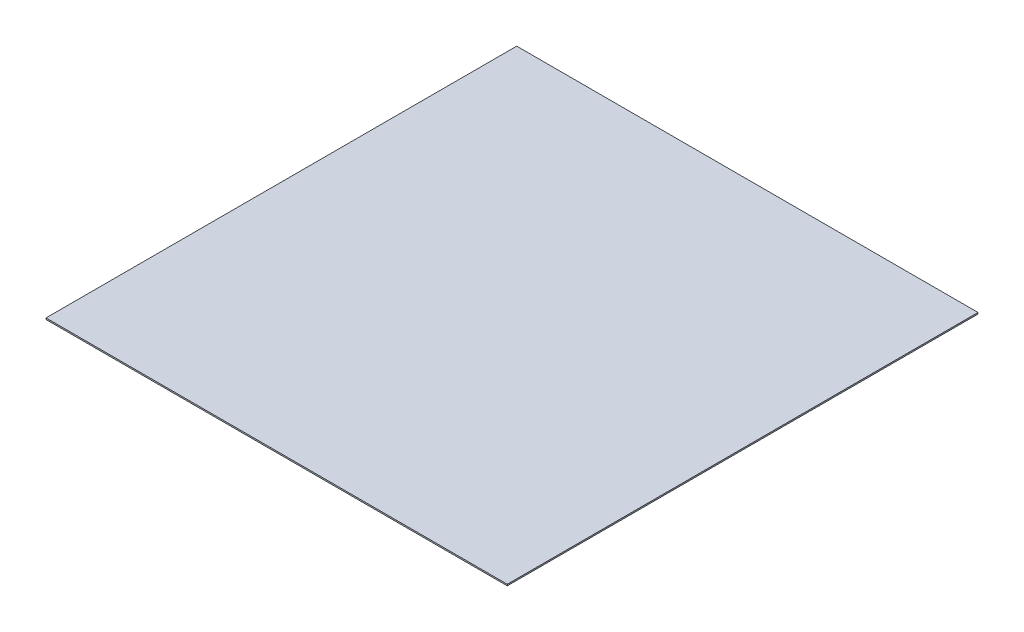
ISO-10303-21;
HEADER;
FILE_DESCRIPTION(('STEP AP214'),'2;1');
FILE_NAME('part.step','',(''),(''),'','','');
FILE_SCHEMA(('AUTOMOTIVE_DESIGN { 1 0 10303 214 1 1 1 1 }'));
ENDSEC;
DATA;
#1=APPLICATION_CONTEXT('core data for automotive mechanical design processes');
#2=APPLICATION_PROTOCOL_DEFINITION('international standard','automotive_design',2000,#1);
#3=PRODUCT_CONTEXT('',#1,'mechanical');
#4=PRODUCT('Part','Part','',(#3));
#5=PRODUCT_RELATED_PRODUCT_CATEGORY('part','',(#4));
#6=PRODUCT_DEFINITION_FORMATION('','',#4);
#7=PRODUCT_DEFINITION_CONTEXT('part definition',#1,'design');
#8=PRODUCT_DEFINITION('design','',#6,#7);
#9=PRODUCT_DEFINITION_SHAPE('','',#8);
#10=(LENGTH_UNIT() NAMED_UNIT(*) SI_UNIT(.MILLI.,.METRE.));
#11=(NAMED_UNIT(*) PLANE_ANGLE_UNIT() SI_UNIT($,.RADIAN.));
#12=(NAMED_UNIT(*) SI_UNIT($,.STERADIAN.) SOLID_ANGLE_UNIT());
#13=UNCERTAINTY_MEASURE_WITH_UNIT(LENGTH_MEASURE(1.E-05),#10,'distance_accuracy_value','');
#14=(GEOMETRIC_REPRESENTATION_CONTEXT(3) GLOBAL_UNCERTAINTY_ASSIGNED_CONTEXT((#13)) GLOBAL_UNIT_ASSIGNED_CONTEXT((#10,
#11,#12)) REPRESENTATION_CONTEXT('',''));
#15=CARTESIAN_POINT('',(0.,0.,0.));
#16=DIRECTION('',(0.,0.,1.));
#17=DIRECTION('',(1.,0.,0.));
#18=AXIS2_PLACEMENT_3D('',#15,#16,#17);
#19=CARTESIAN_POINT('',(-489.999999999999,3.,0.));
#20=DIRECTION('',(1.,0.,0.));
#21=DIRECTION('',(0.,0.,-1.));
#22=AXIS2_PLACEMENT_3D('',#19,#20,#21);
#23=PLANE('',#22);
#24=DIRECTION('',(0.,0.,1.));
#25=VECTOR('',#24,1.);
#26=CARTESIAN_POINT('',(-489.999999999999,0.,0.));
#27=LINE('',#26,#25);
#28=CARTESIAN_POINT('',(-489.999999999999,0.,0.));
#29=VERTEX_POINT('',#28);
#30=CARTESIAN_POINT('',(-489.999999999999,0.,1000.));
#31=VERTEX_POINT('',#30);
#32=EDGE_CURVE('E97',#29,#31,#27,.T.);
#33=ORIENTED_EDGE('',*,*,#32,.T.);
#34=DIRECTION('',(0.,-1.,0.));
#35=VECTOR('',#34,1.);
#36=CARTESIAN_POINT('',(-489.999999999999,3.,1000.));
#37=LINE('',#36,#35);
#38=CARTESIAN_POINT('',(-489.999999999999,3.,1000.));
#39=VERTEX_POINT('',#38);
#40=EDGE_CURVE('E11',#39,#31,#37,.T.);
#41=ORIENTED_EDGE('',*,*,#40,.F.);
#42=DIRECTION('',(0.,0.,1.));
#43=VECTOR('',#42,1.);
#44=CARTESIAN_POINT('',(-489.999999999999,3.,0.));
#45=LINE('',#44,#43);
#46=CARTESIAN_POINT('',(-489.999999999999,3.,0.));
#47=VERTEX_POINT('',#46);
#48=EDGE_CURVE('E85',#47,#39,#45,.T.);
#49=ORIENTED_EDGE('',*,*,#48,.F.);
#50=DIRECTION('',(0.,-1.,0.));
#51=VECTOR('',#50,1.);
#52=CARTESIAN_POINT('',(-489.999999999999,3.,0.));
#53=LINE('',#52,#51);
#54=EDGE_CURVE('E93',#47,#29,#53,.T.);
#55=ORIENTED_EDGE('',*,*,#54,.T.);
#56=EDGE_LOOP('',(#33,#41,#49,#55));
#57=FACE_BOUND('',#56,.T.);
#58=ADVANCED_FACE('F34',(#57),#23,.F.);
#59=CARTESIAN_POINT('',(-489.999999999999,3.,1000.));
#60=DIRECTION('',(0.,0.,-1.));
#61=DIRECTION('',(-1.,0.,0.));
#62=AXIS2_PLACEMENT_3D('',#59,#60,#61);
#63=PLANE('',#62);
#64=DIRECTION('',(1.,0.,0.));
#65=VECTOR('',#64,1.);
#66=CARTESIAN_POINT('',(-489.999999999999,0.,1000.));
#67=LINE('',#66,#65);
#68=CARTESIAN_POINT('',(489.999999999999,0.,1000.));
#69=VERTEX_POINT('',#68);
#70=EDGE_CURVE('E89',#31,#69,#67,.T.);
#71=ORIENTED_EDGE('',*,*,#70,.T.);
#72=DIRECTION('',(0.,-1.,0.));
#73=VECTOR('',#72,1.);
#74=CARTESIAN_POINT('',(489.999999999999,3.,1000.));
#75=LINE('',#74,#73);
#76=CARTESIAN_POINT('',(489.999999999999,3.,1000.));
#77=VERTEX_POINT('',#76);
#78=EDGE_CURVE('E42',#77,#69,#75,.T.);
#79=ORIENTED_EDGE('',*,*,#78,.F.);
#80=DIRECTION('',(1.,0.,0.));
#81=VECTOR('',#80,1.);
#82=CARTESIAN_POINT('',(-489.999999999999,3.,1000.));
#83=LINE('',#82,#81);
#84=EDGE_CURVE('E80',#39,#77,#83,.T.);
#85=ORIENTED_EDGE('',*,*,#84,.F.);
#86=ORIENTED_EDGE('',*,*,#40,.T.);
#87=EDGE_LOOP('',(#71,#79,#85,#86));
#88=FACE_BOUND('',#87,.T.);
#89=ADVANCED_FACE('F88',(#88),#63,.F.);
#90=CARTESIAN_POINT('',(489.999999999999,3.,0.));
#91=DIRECTION('',(-1.,0.,0.));
#92=DIRECTION('',(0.,0.,1.));
#93=AXIS2_PLACEMENT_3D('',#90,#91,#92);
#94=PLANE('',#93);
#95=DIRECTION('',(0.,0.,-1.));
#96=VECTOR('',#95,1.);
#97=CARTESIAN_POINT('',(489.999999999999,0.,0.));
#98=LINE('',#97,#96);
#99=CARTESIAN_POINT('',(489.999999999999,0.,0.));
#100=VERTEX_POINT('',#99);
#101=EDGE_CURVE('E67',#69,#100,#98,.T.);
#102=ORIENTED_EDGE('',*,*,#101,.T.);
#103=DIRECTION('',(0.,-1.,0.));
#104=VECTOR('',#103,1.);
#105=CARTESIAN_POINT('',(489.999999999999,3.,0.));
#106=LINE('',#105,#104);
#107=CARTESIAN_POINT('',(489.999999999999,3.,0.));
#108=VERTEX_POINT('',#107);
#109=EDGE_CURVE('E90',#108,#100,#106,.T.);
#110=ORIENTED_EDGE('',*,*,#109,.F.);
#111=DIRECTION('',(0.,0.,-1.));
#112=VECTOR('',#111,1.);
#113=CARTESIAN_POINT('',(489.999999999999,3.,0.));
#114=LINE('',#113,#112);
#115=EDGE_CURVE('E83',#77,#108,#114,.T.);
#116=ORIENTED_EDGE('',*,*,#115,.F.);
#117=ORIENTED_EDGE('',*,*,#78,.T.);
#118=EDGE_LOOP('',(#102,#110,#116,#117));
#119=FACE_BOUND('',#118,.T.);
#120=ADVANCED_FACE('F91',(#119),#94,.F.);
#121=CARTESIAN_POINT('',(-489.999999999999,3.,0.));
#122=DIRECTION('',(0.,0.,1.));
#123=DIRECTION('',(1.,0.,0.));
#124=AXIS2_PLACEMENT_3D('',#121,#122,#123);
#125=PLANE('',#124);
#126=DIRECTION('',(-1.,0.,0.));
#127=VECTOR('',#126,1.);
#128=CARTESIAN_POINT('',(-489.999999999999,0.,0.));
#129=LINE('',#128,#127);
#130=EDGE_CURVE('E73',#100,#29,#129,.T.);
#131=ORIENTED_EDGE('',*,*,#130,.T.);
#132=ORIENTED_EDGE('',*,*,#54,.F.);
#133=DIRECTION('',(-1.,0.,0.));
#134=VECTOR('',#133,1.);
#135=CARTESIAN_POINT('',(-489.999999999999,3.,0.));
#136=LINE('',#135,#134);
#137=EDGE_CURVE('E50',#108,#47,#136,.T.);
#138=ORIENTED_EDGE('',*,*,#137,.F.);
#139=ORIENTED_EDGE('',*,*,#109,.T.);
#140=EDGE_LOOP('',(#131,#132,#138,#139));
#141=FACE_BOUND('',#140,.T.);
#142=ADVANCED_FACE('F104',(#141),#125,.F.);
#143=CARTESIAN_POINT('',(0.,3.,0.));
#144=DIRECTION('',(0.,1.,0.));
#145=DIRECTION('',(0.,0.,1.));
#146=AXIS2_PLACEMENT_3D('',#143,#144,#145);
#147=PLANE('',#146);
#148=ORIENTED_EDGE('',*,*,#48,.T.);
#149=ORIENTED_EDGE('',*,*,#84,.T.);
#150=ORIENTED_EDGE('',*,*,#115,.T.);
#151=ORIENTED_EDGE('',*,*,#137,.T.);
#152=EDGE_LOOP('',(#148,#149,#150,#151));
#153=FACE_BOUND('',#152,.T.);
#154=ADVANCED_FACE('F81',(#153),#147,.T.);
#155=CARTESIAN_POINT('',(0.,0.,0.));
#156=DIRECTION('',(0.,1.,0.));
#157=DIRECTION('',(0.,0.,1.));
#158=AXIS2_PLACEMENT_3D('',#155,#156,#157);
#159=PLANE('',#158);
#160=ORIENTED_EDGE('',*,*,#32,.F.);
#161=ORIENTED_EDGE('',*,*,#130,.F.);
#162=ORIENTED_EDGE('',*,*,#101,.F.);
#163=ORIENTED_EDGE('',*,*,#70,.F.);
#164=EDGE_LOOP('',(#160,#161,#162,#163));
#165=FACE_BOUND('',#164,.T.);
#166=ADVANCED_FACE('F107',(#165),#159,.F.);
#167=CLOSED_SHELL('',(#58,#89,#120,#142,#154,#166));
#168=MANIFOLD_SOLID_BREP('B2',#167);
#169=ADVANCED_BREP_SHAPE_REPRESENTATION('',(#18,#168),#14);
#170=SHAPE_DEFINITION_REPRESENTATION(#9,#169);
ENDSEC;
END-ISO-10303-21;
